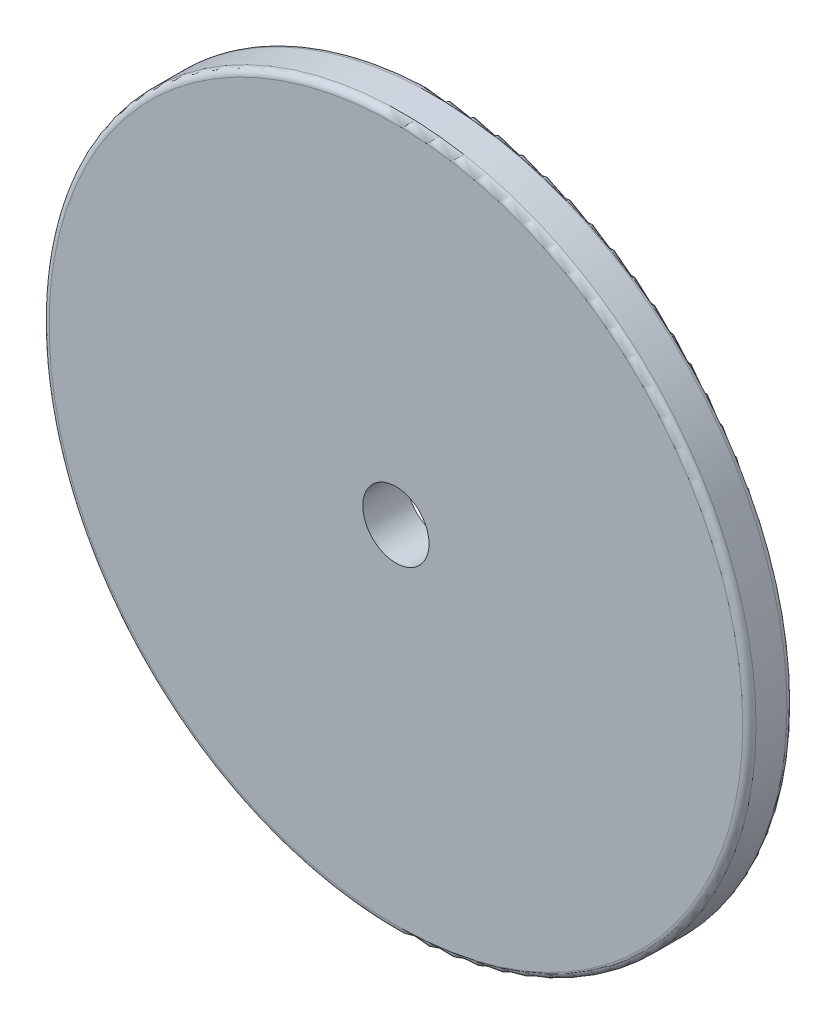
ISO-10303-21;
HEADER;
FILE_DESCRIPTION(('STEP AP214'),'2;1');
FILE_NAME('part.step','',(''),(''),'','','');
FILE_SCHEMA(('AUTOMOTIVE_DESIGN { 1 0 10303 214 1 1 1 1 }'));
ENDSEC;
DATA;
#1=APPLICATION_CONTEXT('core data for automotive mechanical design processes');
#2=APPLICATION_PROTOCOL_DEFINITION('international standard','automotive_design',2000,#1);
#3=PRODUCT_CONTEXT('',#1,'mechanical');
#4=PRODUCT('Part','Part','',(#3));
#5=PRODUCT_RELATED_PRODUCT_CATEGORY('part','',(#4));
#6=PRODUCT_DEFINITION_FORMATION('','',#4);
#7=PRODUCT_DEFINITION_CONTEXT('part definition',#1,'design');
#8=PRODUCT_DEFINITION('design','',#6,#7);
#9=PRODUCT_DEFINITION_SHAPE('','',#8);
#10=(LENGTH_UNIT() NAMED_UNIT(*) SI_UNIT(.MILLI.,.METRE.));
#11=(NAMED_UNIT(*) PLANE_ANGLE_UNIT() SI_UNIT($,.RADIAN.));
#12=(NAMED_UNIT(*) SI_UNIT($,.STERADIAN.) SOLID_ANGLE_UNIT());
#13=UNCERTAINTY_MEASURE_WITH_UNIT(LENGTH_MEASURE(1.E-05),#10,'distance_accuracy_value','');
#14=(GEOMETRIC_REPRESENTATION_CONTEXT(3) GLOBAL_UNCERTAINTY_ASSIGNED_CONTEXT((#13)) GLOBAL_UNIT_ASSIGNED_CONTEXT((#10,
#11,#12)) REPRESENTATION_CONTEXT('',''));
#15=CARTESIAN_POINT('',(0.,0.,0.));
#16=DIRECTION('',(0.,0.,1.));
#17=DIRECTION('',(1.,0.,0.));
#18=AXIS2_PLACEMENT_3D('',#15,#16,#17);
#19=CARTESIAN_POINT('',(0.,0.,2.));
#20=DIRECTION('',(0.,0.,-1.));
#21=DIRECTION('',(-1.,0.,0.));
#22=AXIS2_PLACEMENT_3D('',#19,#20,#21);
#23=CYLINDRICAL_SURFACE('',#22,16.);
#24=CARTESIAN_POINT('',(0.,0.,0.3));
#25=DIRECTION('',(0.,0.,1.));
#26=DIRECTION('',(1.,0.,0.));
#27=AXIS2_PLACEMENT_3D('',#24,#25,#26);
#28=CIRCLE('',#27,16.);
#29=CARTESIAN_POINT('',(16.,0.,0.3));
#30=VERTEX_POINT('',#29);
#31=EDGE_CURVE('E31',#30,#30,#28,.T.);
#32=ORIENTED_EDGE('',*,*,#31,.T.);
#33=EDGE_LOOP('',(#32));
#34=FACE_BOUND('',#33,.T.);
#35=CARTESIAN_POINT('',(0.,0.,1.7));
#36=DIRECTION('',(0.,0.,1.));
#37=DIRECTION('',(1.,0.,0.));
#38=AXIS2_PLACEMENT_3D('',#35,#36,#37);
#39=CIRCLE('',#38,16.);
#40=CARTESIAN_POINT('',(16.,0.,1.7));
#41=VERTEX_POINT('',#40);
#42=EDGE_CURVE('E35',#41,#41,#39,.F.);
#43=ORIENTED_EDGE('',*,*,#42,.T.);
#44=EDGE_LOOP('',(#43));
#45=FACE_BOUND('',#44,.T.);
#46=ADVANCED_FACE('F25',(#34,#45),#23,.T.);
#47=CARTESIAN_POINT('',(0.,0.,2.));
#48=DIRECTION('',(0.,0.,1.));
#49=DIRECTION('',(1.,0.,0.));
#50=AXIS2_PLACEMENT_3D('',#47,#48,#49);
#51=PLANE('',#50);
#52=CARTESIAN_POINT('',(0.,0.,2.));
#53=DIRECTION('',(0.,0.,1.));
#54=DIRECTION('',(1.,0.,0.));
#55=AXIS2_PLACEMENT_3D('',#52,#53,#54);
#56=CIRCLE('',#55,15.7);
#57=CARTESIAN_POINT('',(15.7,0.,2.));
#58=VERTEX_POINT('',#57);
#59=EDGE_CURVE('E39',#58,#58,#56,.T.);
#60=ORIENTED_EDGE('',*,*,#59,.T.);
#61=EDGE_LOOP('',(#60));
#62=FACE_BOUND('',#61,.T.);
#63=CARTESIAN_POINT('',(0.,0.,2.));
#64=DIRECTION('',(0.,0.,1.));
#65=DIRECTION('',(1.,0.,0.));
#66=AXIS2_PLACEMENT_3D('',#63,#64,#65);
#67=CIRCLE('',#66,1.5);
#68=CARTESIAN_POINT('',(1.5,0.,2.));
#69=VERTEX_POINT('',#68);
#70=EDGE_CURVE('E47',#69,#69,#67,.T.);
#71=ORIENTED_EDGE('',*,*,#70,.F.);
#72=EDGE_LOOP('',(#71));
#73=FACE_BOUND('',#72,.T.);
#74=ADVANCED_FACE('F53',(#62,#73),#51,.T.);
#75=CARTESIAN_POINT('',(0.,0.,0.));
#76=DIRECTION('',(0.,0.,1.));
#77=DIRECTION('',(1.,0.,0.));
#78=AXIS2_PLACEMENT_3D('',#75,#76,#77);
#79=PLANE('',#78);
#80=CARTESIAN_POINT('',(0.,0.,0.));
#81=DIRECTION('',(0.,0.,1.));
#82=DIRECTION('',(1.,0.,0.));
#83=AXIS2_PLACEMENT_3D('',#80,#81,#82);
#84=CIRCLE('',#83,15.7);
#85=CARTESIAN_POINT('',(15.7,0.,0.));
#86=VERTEX_POINT('',#85);
#87=EDGE_CURVE('E10',#86,#86,#84,.F.);
#88=ORIENTED_EDGE('',*,*,#87,.T.);
#89=EDGE_LOOP('',(#88));
#90=FACE_BOUND('',#89,.T.);
#91=CARTESIAN_POINT('',(0.,0.,0.));
#92=DIRECTION('',(0.,0.,1.));
#93=DIRECTION('',(1.,0.,0.));
#94=AXIS2_PLACEMENT_3D('',#91,#92,#93);
#95=CIRCLE('',#94,1.5);
#96=CARTESIAN_POINT('',(1.5,0.,0.));
#97=VERTEX_POINT('',#96);
#98=EDGE_CURVE('E44',#97,#97,#95,.T.);
#99=ORIENTED_EDGE('',*,*,#98,.T.);
#100=EDGE_LOOP('',(#99));
#101=FACE_BOUND('',#100,.T.);
#102=ADVANCED_FACE('F55',(#90,#101),#79,.F.);
#103=CARTESIAN_POINT('',(0.,0.,0.));
#104=DIRECTION('',(0.,0.,1.));
#105=DIRECTION('',(1.,0.,0.));
#106=AXIS2_PLACEMENT_3D('',#103,#104,#105);
#107=CYLINDRICAL_SURFACE('',#106,1.5);
#108=ORIENTED_EDGE('',*,*,#98,.F.);
#109=EDGE_LOOP('',(#108));
#110=FACE_BOUND('',#109,.T.);
#111=ORIENTED_EDGE('',*,*,#70,.T.);
#112=EDGE_LOOP('',(#111));
#113=FACE_BOUND('',#112,.T.);
#114=ADVANCED_FACE('F51',(#110,#113),#107,.F.);
#115=CARTESIAN_POINT('',(0.,0.,1.7));
#116=DIRECTION('',(0.,0.,1.));
#117=DIRECTION('',(1.,0.,0.));
#118=AXIS2_PLACEMENT_3D('',#115,#116,#117);
#119=TOROIDAL_SURFACE('',#118,15.7,0.3);
#120=ORIENTED_EDGE('',*,*,#42,.F.);
#121=EDGE_LOOP('',(#120));
#122=FACE_BOUND('',#121,.T.);
#123=ORIENTED_EDGE('',*,*,#59,.F.);
#124=EDGE_LOOP('',(#123));
#125=FACE_BOUND('',#124,.T.);
#126=ADVANCED_FACE('F65',(#122,#125),#119,.T.);
#127=CARTESIAN_POINT('',(0.,0.,0.3));
#128=DIRECTION('',(0.,0.,1.));
#129=DIRECTION('',(1.,0.,0.));
#130=AXIS2_PLACEMENT_3D('',#127,#128,#129);
#131=TOROIDAL_SURFACE('',#130,15.7,0.3);
#132=ORIENTED_EDGE('',*,*,#87,.F.);
#133=EDGE_LOOP('',(#132));
#134=FACE_BOUND('',#133,.T.);
#135=ORIENTED_EDGE('',*,*,#31,.F.);
#136=EDGE_LOOP('',(#135));
#137=FACE_BOUND('',#136,.T.);
#138=ADVANCED_FACE('F69',(#134,#137),#131,.T.);
#139=CLOSED_SHELL('',(#46,#74,#102,#114,#126,#138));
#140=MANIFOLD_SOLID_BREP('B2',#139);
#141=ADVANCED_BREP_SHAPE_REPRESENTATION('',(#18,#140),#14);
#142=SHAPE_DEFINITION_REPRESENTATION(#9,#141);
ENDSEC;
END-ISO-10303-21;
